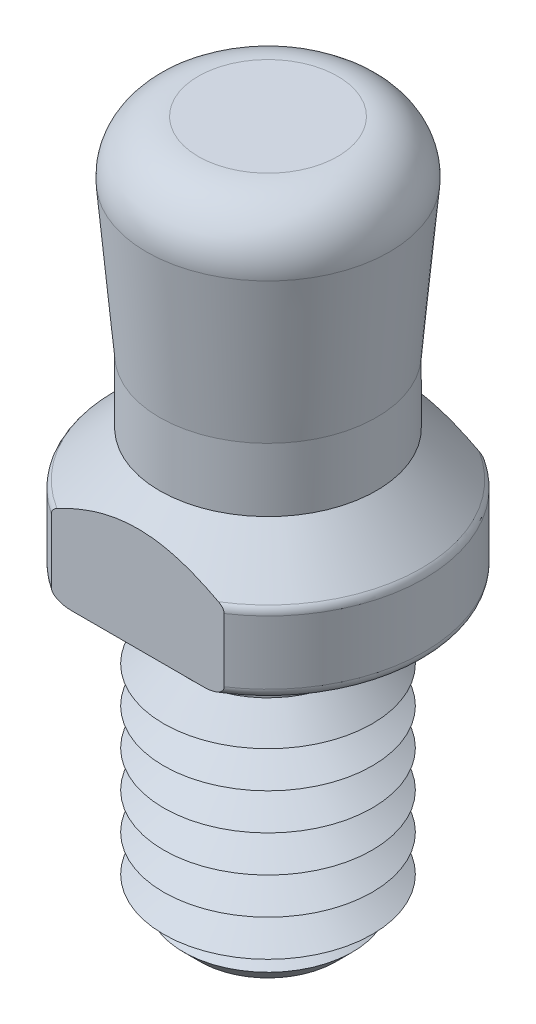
from build123d import *

# Parameters (mm, degrees)
CUT_EXTRUDE1_DEPTH = 2
CHAMFER2_SIZE      = 0.7
LPATTERN1_COUNT    = 6
LPATTERN1_PITCH    = 0.7


with BuildPart() as part:
    # Sketch2 → Revolve1 (revolve)
    with BuildSketch(Plane(origin=(0, 0, 0), x_dir=(0, 0, -1), z_dir=(1, 0, 0))):
        with BuildLine():
            Line((0, 0), (-2.8, 0))
            ThreePointArc((-2.8, 0), (-2.941421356, 0.058578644), (-3, 0.2))
            Line((-3, 0.2), (-3, 1.417157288))
            ThreePointArc((-3, 1.417157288), (-2.984775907, 1.493693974), (-2.941421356, 1.558578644))
            Line((-2.941421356, 1.558578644), (-2.080761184, 2.419238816))
            Line((-2.080761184, 2.419238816), (-2.080761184, 3.636396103))
            Line((-2.080761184, 3.636396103), (-2.332417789, 6.512844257))
            ThreePointArc((-2.332417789, 6.512844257), (-2.073500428, 7.275590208), (-1.336223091, 7.6))
            Line((-1.336223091, 7.6), (0, 7.6))
            Line((0, 7.6), (0, 0))
        make_face()
    revolve(axis=Axis((0, 69.540327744, 0), (0, -1, 0)))

    # Sketch4 → Cut-Extrude1 (cut)
    with BuildSketch(Plane(origin=(0, 0, 0), x_dir=(1, 0, 0), z_dir=(0, 1, 0))):
        with BuildLine():
            Line((-2.09737954, -2.5), (2.09737954, -2.5))
            ThreePointArc((2.09737954, -2.5), (0, -3.263280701), (-2.09737954, -2.5))
        make_face()
        with BuildLine():
            Line((2.09737954, 2.5), (-2.09737954, 2.5))
            ThreePointArc((-2.09737954, 2.5), (0, 3.263280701), (2.09737954, 2.5))
        make_face()
    extrude(amount=CUT_EXTRUDE1_DEPTH, mode=Mode.SUBTRACT)

    # Sketch5 → Revolve3 (revolve)
    with BuildSketch(Plane(origin=(0, 0, 0), x_dir=(0, 0, -1), z_dir=(1, 0, 0))):
        Polygon((0, 0), (-1.505025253, 0), (-1.505025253, -1), (-2, -1.494974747), (-2, -5.8), (0, -5.8), align=None)
    revolve(axis=Axis((0, 69.540327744, 0), (0, -1, 0)))

    # Chamfer2
    chamfer2_edges = [part.edges().sort_by_distance(p)[0] for p in [
        (0, -5.8, -2),
    ]]
    chamfer(chamfer2_edges, length=CHAMFER2_SIZE)

    # Sketch6 → Cut-Revolve1 (revolve, cut)
    with BuildSketch(Plane(origin=(0, 0, 0), x_dir=(0, 0, -1), z_dir=(1, 0, 0))):
        Polygon((-2, -1.494974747), (-1.393782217, -1.844974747), (-2, -2.194974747), align=None)
    cut_revolve1 = revolve(axis=Axis((0, 69.540327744, 0), (0, -1, 0)), mode=Mode.SUBTRACT)

    # LPattern1: Cut-Revolve1 ×6
    with Locations(*[(0, -i * LPATTERN1_PITCH, 0) for i in range(1, LPATTERN1_COUNT)]):
        add(cut_revolve1, mode=Mode.SUBTRACT)


solid = part.part
